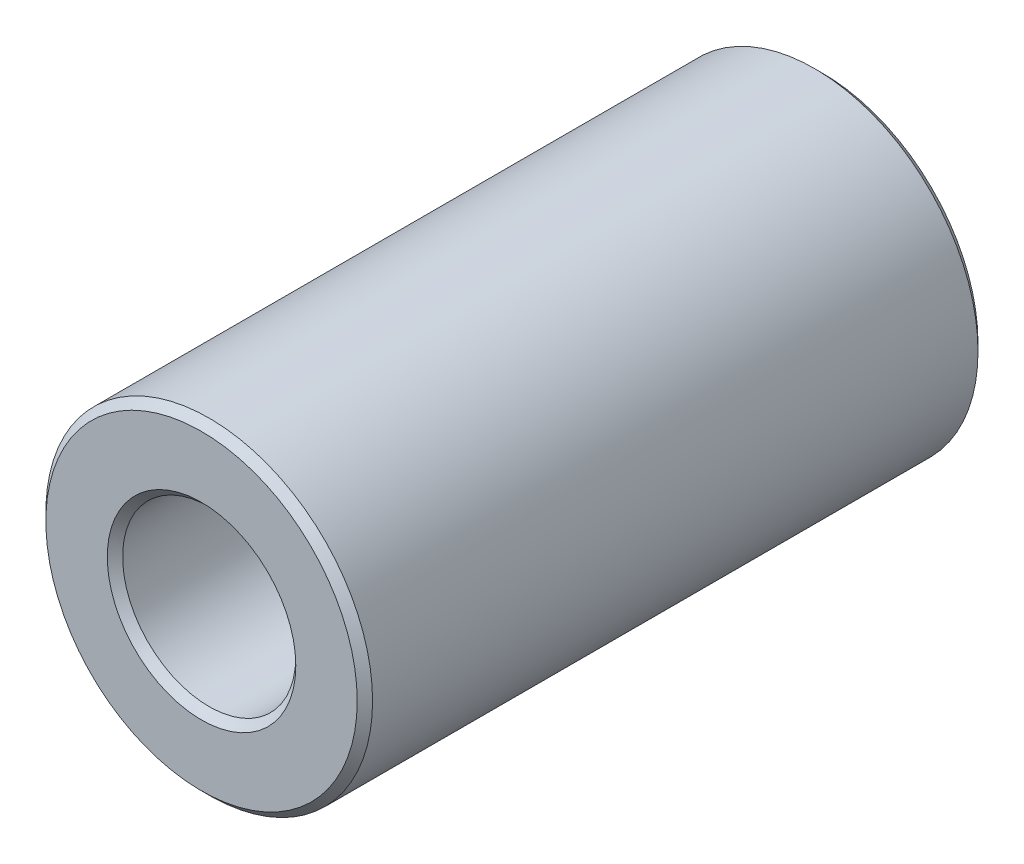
from build123d import *

# Parameters (mm, degrees)
BOSS_EXTRUDE1_DEPTH      = 9.5
BOSS_EXTRUDE1_DEPTH_BACK = 9.5
SKETCH3_R                = 5
SKETCH3_R_2              = 2.65
CHAMFER1_SIZE            = 0.235


with BuildPart() as part:
    # Sketch3 → Boss-Extrude1 (new, two sides: drawn at the far end of the back side and taken through both)
    with BuildSketch(Plane.XY.offset(-BOSS_EXTRUDE1_DEPTH_BACK)):
        Circle(SKETCH3_R)
        Circle(SKETCH3_R_2, mode=Mode.SUBTRACT)
    extrude(amount=BOSS_EXTRUDE1_DEPTH + BOSS_EXTRUDE1_DEPTH_BACK)

    # Chamfer1
    chamfer1_edges = [part.edges().sort_by_distance(p)[0] for p in [
        (-5, 0, -9.5),
        (-2.65, 0, -9.5),
        (-5, 0, 9.5),
        (-2.65, 0, 9.5),
    ]]
    chamfer(chamfer1_edges, length=CHAMFER1_SIZE)


solid = part.part
